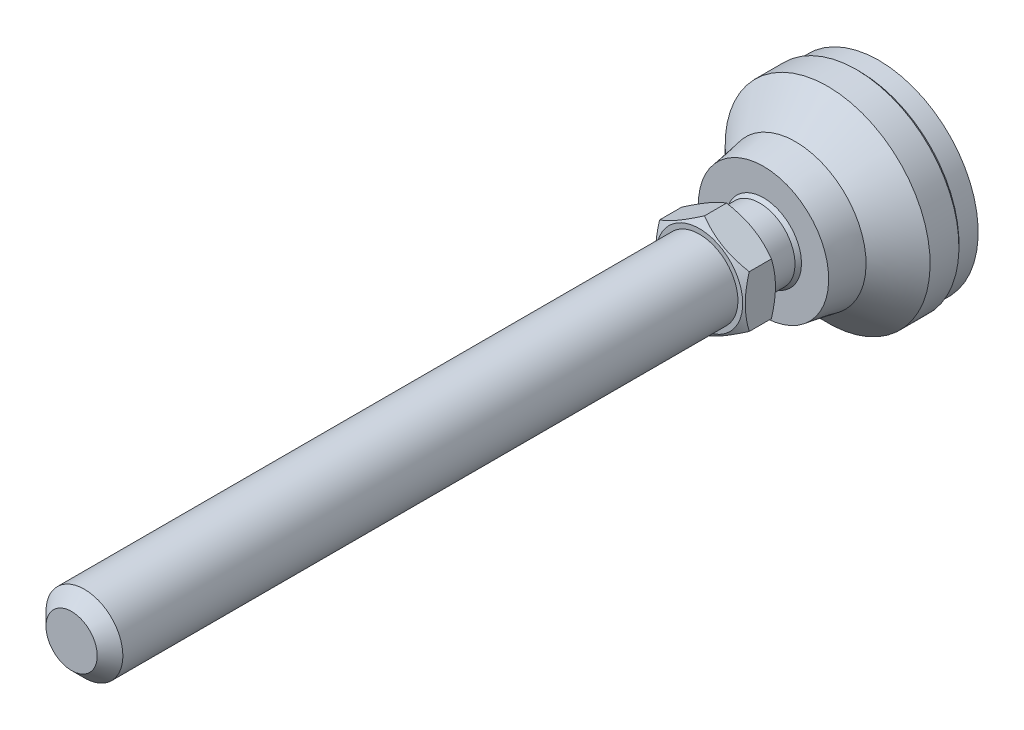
ISO-10303-21;
HEADER;
FILE_DESCRIPTION(('STEP AP214'),'2;1');
FILE_NAME('part.step','',(''),(''),'','','');
FILE_SCHEMA(('AUTOMOTIVE_DESIGN { 1 0 10303 214 1 1 1 1 }'));
ENDSEC;
DATA;
#1=APPLICATION_CONTEXT('core data for automotive mechanical design processes');
#2=APPLICATION_PROTOCOL_DEFINITION('international standard','automotive_design',2000,#1);
#3=PRODUCT_CONTEXT('',#1,'mechanical');
#4=PRODUCT('Part','Part','',(#3));
#5=PRODUCT_RELATED_PRODUCT_CATEGORY('part','',(#4));
#6=PRODUCT_DEFINITION_FORMATION('','',#4);
#7=PRODUCT_DEFINITION_CONTEXT('part definition',#1,'design');
#8=PRODUCT_DEFINITION('design','',#6,#7);
#9=PRODUCT_DEFINITION_SHAPE('','',#8);
#10=(LENGTH_UNIT() NAMED_UNIT(*) SI_UNIT(.MILLI.,.METRE.));
#11=(NAMED_UNIT(*) PLANE_ANGLE_UNIT() SI_UNIT($,.RADIAN.));
#12=(NAMED_UNIT(*) SI_UNIT($,.STERADIAN.) SOLID_ANGLE_UNIT());
#13=UNCERTAINTY_MEASURE_WITH_UNIT(LENGTH_MEASURE(1.E-05),#10,'distance_accuracy_value','');
#14=(GEOMETRIC_REPRESENTATION_CONTEXT(3) GLOBAL_UNCERTAINTY_ASSIGNED_CONTEXT((#13)) GLOBAL_UNIT_ASSIGNED_CONTEXT((#10,
#11,#12)) REPRESENTATION_CONTEXT('',''));
#15=CARTESIAN_POINT('',(0.,0.,0.));
#16=DIRECTION('',(0.,0.,1.));
#17=DIRECTION('',(1.,0.,0.));
#18=AXIS2_PLACEMENT_3D('',#15,#16,#17);
#19=CARTESIAN_POINT('',(0.,0.,3.));
#20=DIRECTION('',(0.,0.,-1.));
#21=DIRECTION('',(0.,1.,0.));
#22=AXIS2_PLACEMENT_3D('',#19,#20,#21);
#23=CYLINDRICAL_SURFACE('',#22,5.50000000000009);
#24=CARTESIAN_POINT('',(0.,0.,22.9999999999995));
#25=DIRECTION('',(0.,0.,-1.));
#26=DIRECTION('',(0.,1.,0.));
#27=AXIS2_PLACEMENT_3D('',#24,#25,#26);
#28=CIRCLE('',#27,5.50000000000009);
#29=CARTESIAN_POINT('',(0.,5.50000000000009,22.9999999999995));
#30=VERTEX_POINT('',#29);
#31=EDGE_CURVE('E112',#30,#30,#28,.T.);
#32=ORIENTED_EDGE('',*,*,#31,.T.);
#33=EDGE_LOOP('',(#32));
#34=FACE_BOUND('',#33,.T.);
#35=CARTESIAN_POINT('',(0.,0.,18.5902313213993));
#36=DIRECTION('',(0.,0.,-1.));
#37=DIRECTION('',(0.,1.,0.));
#38=AXIS2_PLACEMENT_3D('',#35,#36,#37);
#39=CIRCLE('',#38,5.50000000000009);
#40=CARTESIAN_POINT('',(-5.50000000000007,0.,18.5902313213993));
#41=VERTEX_POINT('',#40);
#42=EDGE_CURVE('E284',#41,#41,#39,.T.);
#43=ORIENTED_EDGE('',*,*,#42,.F.);
#44=EDGE_LOOP('',(#43));
#45=FACE_BOUND('',#44,.T.);
#46=ADVANCED_FACE('F14',(#34,#45),#23,.T.);
#47=CARTESIAN_POINT('',(0.,0.,14.2601043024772));
#48=DIRECTION('',(0.,0.,-1.));
#49=DIRECTION('',(-1.,0.,0.));
#50=AXIS2_PLACEMENT_3D('',#47,#48,#49);
#51=SPHERICAL_SURFACE('',#50,7.);
#52=CARTESIAN_POINT('',(0.,0.,18.));
#53=DIRECTION('',(0.,0.,-1.));
#54=DIRECTION('',(0.,1.,0.));
#55=AXIS2_PLACEMENT_3D('',#52,#53,#54);
#56=CIRCLE('',#55,5.91719360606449);
#57=CARTESIAN_POINT('',(-5.91719360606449,0.,18.));
#58=VERTEX_POINT('',#57);
#59=EDGE_CURVE('E115',#58,#58,#56,.T.);
#60=CARTESIAN_POINT('',(-5.50000000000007,0.,18.5902313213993));
#61=CARTESIAN_POINT('',(-5.50465946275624,0.,18.5843130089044));
#62=CARTESIAN_POINT('',(-5.50930937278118,0.,18.5783871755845));
#63=CARTESIAN_POINT('',(-5.51859003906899,0.,18.5665205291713));
#64=CARTESIAN_POINT('',(-5.52322079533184,0.,18.5605797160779));
#65=CARTESIAN_POINT('',(-5.53246310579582,0.,18.5486831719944));
#66=CARTESIAN_POINT('',(-5.53707465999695,0.,18.5427274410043));
#67=CARTESIAN_POINT('',(-5.54627851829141,0.,18.5308011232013));
#68=CARTESIAN_POINT('',(-5.55087082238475,0.,18.5248305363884));
#69=CARTESIAN_POINT('',(-5.56003613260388,0.,18.5128745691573));
#70=CARTESIAN_POINT('',(-5.56460913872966,0.,18.5068891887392));
#71=CARTESIAN_POINT('',(-5.57373580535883,0.,18.4949036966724));
#72=CARTESIAN_POINT('',(-5.57828946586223,0.,18.4889035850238));
#73=CARTESIAN_POINT('',(-5.58737739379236,0.,18.4768886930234));
#74=CARTESIAN_POINT('',(-5.59191166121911,0.,18.4708739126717));
#75=CARTESIAN_POINT('',(-5.60096075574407,0.,18.4588297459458));
#76=CARTESIAN_POINT('',(-5.60547558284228,0.,18.4528003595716));
#77=CARTESIAN_POINT('',(-5.6144857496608,0.,18.4407270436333));
#78=CARTESIAN_POINT('',(-5.61898108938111,0.,18.4346831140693));
#79=CARTESIAN_POINT('',(-5.62795223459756,0.,18.4225807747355));
#80=CARTESIAN_POINT('',(-5.6324280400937,0.,18.4165223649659));
#81=CARTESIAN_POINT('',(-5.64136007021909,0.,18.4043911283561));
#82=CARTESIAN_POINT('',(-5.64581629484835,0.,18.398318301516));
#83=CARTESIAN_POINT('',(-5.65470911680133,0.,18.3861582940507));
#84=CARTESIAN_POINT('',(-5.65914571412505,0.,18.3800711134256));
#85=CARTESIAN_POINT('',(-5.66799923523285,0.,18.3678824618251));
#86=CARTESIAN_POINT('',(-5.67241615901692,0.,18.3617809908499));
#87=CARTESIAN_POINT('',(-5.68123028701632,0.,18.3495638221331));
#88=CARTESIAN_POINT('',(-5.68562749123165,0.,18.3434481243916));
#89=CARTESIAN_POINT('',(-5.69440213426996,0.,18.3312025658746));
#90=CARTESIAN_POINT('',(-5.69877957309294,0.,18.3250727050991));
#91=CARTESIAN_POINT('',(-5.70751463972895,0.,18.3127988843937));
#92=CARTESIAN_POINT('',(-5.71187226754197,0.,18.3066549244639));
#93=CARTESIAN_POINT('',(-5.72056766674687,0.,18.2943529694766));
#94=CARTESIAN_POINT('',(-5.72490543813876,0.,18.2881949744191));
#95=CARTESIAN_POINT('',(-5.73356107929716,0.,18.2758650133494));
#96=CARTESIAN_POINT('',(-5.73787894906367,0.,18.2696930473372));
#97=CARTESIAN_POINT('',(-5.74649474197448,0.,18.2573352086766));
#98=CARTESIAN_POINT('',(-5.75079266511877,0.,18.2511493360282));
#99=CARTESIAN_POINT('',(-5.75936851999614,0.,18.2387637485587));
#100=CARTESIAN_POINT('',(-5.76364645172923,0.,18.2325640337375));
#101=CARTESIAN_POINT('',(-5.77218227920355,0.,18.2201508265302));
#102=CARTESIAN_POINT('',(-5.77644017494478,0.,18.2139373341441));
#103=CARTESIAN_POINT('',(-5.78493588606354,0.,18.2014966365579));
#104=CARTESIAN_POINT('',(-5.78917370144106,0.,18.195269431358));
#105=CARTESIAN_POINT('',(-5.79762920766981,0.,18.1828013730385));
#106=CARTESIAN_POINT('',(-5.80184689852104,0.,18.1765605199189));
#107=CARTESIAN_POINT('',(-5.81026211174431,0.,18.1640652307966));
#108=CARTESIAN_POINT('',(-5.81445963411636,0.,18.1578107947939));
#109=CARTESIAN_POINT('',(-5.82283446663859,0.,18.1452884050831));
#110=CARTESIAN_POINT('',(-5.82701177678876,0.,18.1390204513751));
#111=CARTESIAN_POINT('',(-5.83534614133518,0.,18.1264710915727));
#112=CARTESIAN_POINT('',(-5.83950319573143,0.,18.1201896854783));
#113=CARTESIAN_POINT('',(-5.84779700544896,0.,18.107613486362));
#114=CARTESIAN_POINT('',(-5.85193376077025,0.,18.1013186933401));
#115=CARTESIAN_POINT('',(-5.86018692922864,0.,18.0887157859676));
#116=CARTESIAN_POINT('',(-5.86430334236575,0.,18.082407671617));
#117=CARTESIAN_POINT('',(-5.87251578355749,0.,18.0697781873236));
#118=CARTESIAN_POINT('',(-5.87661181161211,0.,18.063456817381));
#119=CARTESIAN_POINT('',(-5.88478343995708,0.,18.0508008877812));
#120=CARTESIAN_POINT('',(-5.88885904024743,0.,18.044466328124));
#121=CARTESIAN_POINT('',(-5.89698977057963,0.,18.0317840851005));
#122=CARTESIAN_POINT('',(-5.90104490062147,0.,18.0254364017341));
#123=CARTESIAN_POINT('',(-5.909134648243,0.,18.0127279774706));
#124=CARTESIAN_POINT('',(-5.91316926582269,0.,18.0063672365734));
#125=CARTESIAN_POINT('',(-5.91719360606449,0.,18.));
#126=B_SPLINE_CURVE_WITH_KNOTS('',3,(#60,#61,#62,#63,#64,#65,#66,#67,#68,#69,#70,#71,#72,#73,
#74,#75,#76,#77,#78,#79,#80,#81,#82,#83,#84,#85,#86,#87,#88,#89,#90,#91,#92,#93,#94,#95,#96,#97,
#98,#99,#100,#101,#102,#103,#104,#105,#106,#107,#108,#109,#110,#111,#112,#113,#114,#115,#116,
#117,#118,#119,#120,#121,#122,#123,#124,#125),.UNSPECIFIED.,.F.,.F.,(4,2,2,2,2,2,2,2,2,2,2,2,2,
2,2,2,2,2,2,2,2,2,2,2,2,2,2,2,2,2,2,2,4),(0.,0.0225971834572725,0.0451943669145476,
0.067791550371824,0.0903887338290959,0.112985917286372,0.135583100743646,0.158180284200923,
0.180777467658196,0.203374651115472,0.225971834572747,0.24856901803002,0.271166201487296,
0.293763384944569,0.316360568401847,0.338957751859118,0.361554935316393,0.384152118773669,
0.406749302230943,0.429346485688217,0.451943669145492,0.474540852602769,0.49713803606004,
0.519735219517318,0.542332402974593,0.564929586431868,0.587526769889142,0.610123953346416,
0.632721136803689,0.655318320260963,0.67791550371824,0.700512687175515,0.723109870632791),.UNSPECIFIED.);
#127=EDGE_CURVE('BSEAM243',#41,#58,#126,.T.);
#128=ORIENTED_EDGE('',*,*,#42,.T.);
#129=ORIENTED_EDGE('',*,*,#59,.F.);
#130=ORIENTED_EDGE('',*,*,#127,.T.);
#131=ORIENTED_EDGE('',*,*,#127,.F.);
#132=EDGE_LOOP('',(#128,#130,#129,#131));
#133=FACE_BOUND('',#132,.T.);
#134=ADVANCED_FACE('F243',(#133),#51,.T.);
#135=CARTESIAN_POINT('',(0.,0.,3.5));
#136=DIRECTION('',(0.,0.,1.));
#137=DIRECTION('',(0.,-1.,0.));
#138=AXIS2_PLACEMENT_3D('',#135,#136,#137);
#139=CONICAL_SURFACE('',#138,16.,0.785398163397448);
#140=CARTESIAN_POINT('',(0.,0.,3.));
#141=DIRECTION('',(0.,0.,-1.));
#142=DIRECTION('',(0.,1.,0.));
#143=AXIS2_PLACEMENT_3D('',#140,#141,#142);
#144=CIRCLE('',#143,15.5);
#145=CARTESIAN_POINT('',(0.,15.5,3.));
#146=VERTEX_POINT('',#145);
#147=EDGE_CURVE('E85',#146,#146,#144,.T.);
#148=ORIENTED_EDGE('',*,*,#147,.F.);
#149=EDGE_LOOP('',(#148));
#150=FACE_BOUND('',#149,.T.);
#151=CARTESIAN_POINT('',(0.,0.,3.5));
#152=DIRECTION('',(0.,0.,-1.));
#153=DIRECTION('',(0.,1.,0.));
#154=AXIS2_PLACEMENT_3D('',#151,#152,#153);
#155=CIRCLE('',#154,16.);
#156=CARTESIAN_POINT('',(0.,16.,3.5));
#157=VERTEX_POINT('',#156);
#158=EDGE_CURVE('E88',#157,#157,#155,.T.);
#159=ORIENTED_EDGE('',*,*,#158,.T.);
#160=EDGE_LOOP('',(#159));
#161=FACE_BOUND('',#160,.T.);
#162=ADVANCED_FACE('F246',(#150,#161),#139,.T.);
#163=CARTESIAN_POINT('',(0.,0.,3.));
#164=DIRECTION('',(0.,0.,-1.));
#165=DIRECTION('',(0.,1.,0.));
#166=AXIS2_PLACEMENT_3D('',#163,#164,#165);
#167=CYLINDRICAL_SURFACE('',#166,16.);
#168=ORIENTED_EDGE('',*,*,#158,.F.);
#169=EDGE_LOOP('',(#168));
#170=FACE_BOUND('',#169,.T.);
#171=CARTESIAN_POINT('',(0.,0.,8.00000000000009));
#172=DIRECTION('',(0.,0.,-1.));
#173=DIRECTION('',(0.,1.,0.));
#174=AXIS2_PLACEMENT_3D('',#171,#172,#173);
#175=CIRCLE('',#174,16.);
#176=CARTESIAN_POINT('',(0.,16.,8.00000000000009));
#177=VERTEX_POINT('',#176);
#178=EDGE_CURVE('E105',#177,#177,#175,.T.);
#179=ORIENTED_EDGE('',*,*,#178,.T.);
#180=EDGE_LOOP('',(#179));
#181=FACE_BOUND('',#180,.T.);
#182=ADVANCED_FACE('F392',(#170,#181),#167,.T.);
#183=CARTESIAN_POINT('',(0.,0.,13.));
#184=DIRECTION('',(0.,0.,-1.));
#185=DIRECTION('',(0.,1.,0.));
#186=AXIS2_PLACEMENT_3D('',#183,#184,#185);
#187=CONICAL_SURFACE('',#186,11.,0.785398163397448);
#188=ORIENTED_EDGE('',*,*,#178,.F.);
#189=EDGE_LOOP('',(#188));
#190=FACE_BOUND('',#189,.T.);
#191=CARTESIAN_POINT('',(0.,0.,13.));
#192=DIRECTION('',(0.,0.,-1.));
#193=DIRECTION('',(0.,1.,0.));
#194=AXIS2_PLACEMENT_3D('',#191,#192,#193);
#195=CIRCLE('',#194,11.);
#196=CARTESIAN_POINT('',(0.,11.,13.));
#197=VERTEX_POINT('',#196);
#198=EDGE_CURVE('E108',#197,#197,#195,.T.);
#199=ORIENTED_EDGE('',*,*,#198,.T.);
#200=EDGE_LOOP('',(#199));
#201=FACE_BOUND('',#200,.T.);
#202=ADVANCED_FACE('F399',(#190,#201),#187,.T.);
#203=CARTESIAN_POINT('',(0.,0.,19.));
#204=DIRECTION('',(0.,0.,-1.));
#205=DIRECTION('',(0.,1.,0.));
#206=AXIS2_PLACEMENT_3D('',#203,#204,#205);
#207=CONICAL_SURFACE('',#206,10.,0.165148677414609);
#208=ORIENTED_EDGE('',*,*,#198,.F.);
#209=EDGE_LOOP('',(#208));
#210=FACE_BOUND('',#209,.T.);
#211=CARTESIAN_POINT('',(0.,0.,18.));
#212=DIRECTION('',(0.,0.,-1.));
#213=DIRECTION('',(0.,1.,0.));
#214=AXIS2_PLACEMENT_3D('',#211,#212,#213);
#215=CIRCLE('',#214,10.1666666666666);
#216=CARTESIAN_POINT('',(0.,10.1666666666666,18.));
#217=VERTEX_POINT('',#216);
#218=EDGE_CURVE('E93',#217,#217,#215,.T.);
#219=ORIENTED_EDGE('',*,*,#218,.T.);
#220=EDGE_LOOP('',(#219));
#221=FACE_BOUND('',#220,.T.);
#222=ADVANCED_FACE('F241',(#210,#221),#207,.T.);
#223=CARTESIAN_POINT('',(-6.60079601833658,0.,18.));
#224=DIRECTION('',(0.,0.,1.));
#225=DIRECTION('',(0.,-1.,0.));
#226=AXIS2_PLACEMENT_3D('',#223,#224,#225);
#227=PLANE('',#226);
#228=ORIENTED_EDGE('',*,*,#218,.F.);
#229=EDGE_LOOP('',(#228));
#230=FACE_BOUND('',#229,.T.);
#231=ORIENTED_EDGE('',*,*,#59,.T.);
#232=EDGE_LOOP('',(#231));
#233=FACE_BOUND('',#232,.T.);
#234=ADVANCED_FACE('F236',(#230,#233),#227,.T.);
#235=CARTESIAN_POINT('',(0.,-8.08290376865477,22.9999999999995));
#236=DIRECTION('',(0.,0.,-1.));
#237=DIRECTION('',(0.,1.,0.));
#238=AXIS2_PLACEMENT_3D('',#235,#236,#237);
#239=PLANE('',#238);
#240=CARTESIAN_POINT('',(0.,0.,22.9999999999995));
#241=DIRECTION('',(0.,0.,1.));
#242=DIRECTION('',(0.,-1.,0.));
#243=AXIS2_PLACEMENT_3D('',#240,#241,#242);
#244=CIRCLE('',#243,6.75);
#245=CARTESIAN_POINT('',(0.,-6.75,22.9999999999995));
#246=VERTEX_POINT('',#245);
#247=EDGE_CURVE('E80',#246,#246,#244,.T.);
#248=ORIENTED_EDGE('',*,*,#247,.F.);
#249=EDGE_LOOP('',(#248));
#250=FACE_BOUND('',#249,.T.);
#251=ORIENTED_EDGE('',*,*,#31,.F.);
#252=EDGE_LOOP('',(#251));
#253=FACE_BOUND('',#252,.T.);
#254=ADVANCED_FACE('F240',(#250,#253),#239,.T.);
#255=CARTESIAN_POINT('',(0.,0.,0.));
#256=DIRECTION('',(0.,0.,1.));
#257=DIRECTION('',(0.,-1.,0.));
#258=AXIS2_PLACEMENT_3D('',#255,#256,#257);
#259=CYLINDRICAL_SURFACE('',#258,15.5);
#260=CARTESIAN_POINT('',(0.,0.,0.));
#261=DIRECTION('',(0.,0.,-1.));
#262=DIRECTION('',(0.,1.,0.));
#263=AXIS2_PLACEMENT_3D('',#260,#261,#262);
#264=CIRCLE('',#263,15.5);
#265=CARTESIAN_POINT('',(0.,15.5,0.));
#266=VERTEX_POINT('',#265);
#267=EDGE_CURVE('E293',#266,#266,#264,.T.);
#268=ORIENTED_EDGE('',*,*,#267,.F.);
#269=EDGE_LOOP('',(#268));
#270=FACE_BOUND('',#269,.T.);
#271=ORIENTED_EDGE('',*,*,#147,.T.);
#272=EDGE_LOOP('',(#271));
#273=FACE_BOUND('',#272,.T.);
#274=ADVANCED_FACE('F250',(#270,#273),#259,.T.);
#275=CARTESIAN_POINT('',(0.,0.,0.));
#276=DIRECTION('',(0.,0.,-1.));
#277=DIRECTION('',(0.,1.,0.));
#278=AXIS2_PLACEMENT_3D('',#275,#276,#277);
#279=PLANE('',#278);
#280=ORIENTED_EDGE('',*,*,#267,.T.);
#281=EDGE_LOOP('',(#280));
#282=FACE_BOUND('',#281,.T.);
#283=ADVANCED_FACE('F133',(#282),#279,.T.);
#284=CARTESIAN_POINT('',(0.,0.,22.9999999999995));
#285=DIRECTION('',(0.,0.,1.));
#286=DIRECTION('',(0.,-1.,0.));
#287=AXIS2_PLACEMENT_3D('',#284,#285,#286);
#288=CONICAL_SURFACE('',#287,6.75,1.0471975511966);
#289=CARTESIAN_POINT('',(7.0002,-4.04133641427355,23.7696190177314));
#290=CARTESIAN_POINT('',(6.84633209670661,-4.13017208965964,23.7183374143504));
#291=CARTESIAN_POINT('',(6.69189049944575,-4.21933898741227,23.6693831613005));
#292=CARTESIAN_POINT('',(6.38175307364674,-4.3983969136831,23.576770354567));
#293=CARTESIAN_POINT('',(6.22605673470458,-4.4882882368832,23.5331140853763));
#294=CARTESIAN_POINT('',(5.75647483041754,-4.7594014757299,23.4109491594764));
#295=CARTESIAN_POINT('',(5.4407356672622,-4.94169356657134,23.3414631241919));
#296=CARTESIAN_POINT('',(4.96823775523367,-5.21449036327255,23.259982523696));
#297=CARTESIAN_POINT('',(4.81289077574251,-5.30417998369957,23.2367710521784));
#298=CARTESIAN_POINT('',(4.50149488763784,-5.48396448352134,23.1978487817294));
#299=CARTESIAN_POINT('',(4.34544604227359,-5.57405932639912,23.1821373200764));
#300=CARTESIAN_POINT('',(4.03307732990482,-5.75440548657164,23.15861548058));
#301=CARTESIAN_POINT('',(3.87675797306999,-5.84465650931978,23.1507961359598));
#302=CARTESIAN_POINT('',(3.56398349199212,-6.02523694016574,23.1432178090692));
#303=CARTESIAN_POINT('',(3.40752837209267,-6.11556634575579,23.1434585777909));
#304=CARTESIAN_POINT('',(2.97889312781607,-6.36303901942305,23.1551972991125));
#305=CARTESIAN_POINT('',(2.7068533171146,-6.52010127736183,23.1749033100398));
#306=CARTESIAN_POINT('',(2.16458055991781,-6.83318259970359,23.2373910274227));
#307=CARTESIAN_POINT('',(1.89434952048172,-6.98920056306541,23.2801940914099));
#308=CARTESIAN_POINT('',(1.35098545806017,-7.30291195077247,23.3871892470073));
#309=CARTESIAN_POINT('',(1.07792099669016,-7.46056579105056,23.4518346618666));
#310=CARTESIAN_POINT('',(0.535864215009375,-7.77352241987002,23.5985536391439));
#311=CARTESIAN_POINT('',(0.266864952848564,-7.92882921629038,23.6805927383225));
#312=CARTESIAN_POINT('',(-0.000199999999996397,-8.08301923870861,23.7696190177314));
#313=B_SPLINE_CURVE_WITH_KNOTS('',3,(#289,#290,#291,#292,#293,#294,#295,#296,#297,#298,#299,
#300,#301,#302,#303,#304,#305,#306,#307,#308,#309,#310,#311,#312),.UNSPECIFIED.,.F.,.F.,(4,2,2,
2,2,2,2,2,2,2,2,4),(0.,0.554727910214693,1.10969417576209,2.2219327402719,2.76443041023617,
3.30688013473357,3.8487128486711,4.39052882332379,5.33376515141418,6.27787517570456,
7.24292418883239,8.20607866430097),.UNSPECIFIED.);
#314=CARTESIAN_POINT('',(7.,-4.04145188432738,23.7695523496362));
#315=VERTEX_POINT('',#314);
#316=CARTESIAN_POINT('',(0.,-8.08290376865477,23.7695523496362));
#317=VERTEX_POINT('',#316);
#318=EDGE_CURVE('E33',#315,#317,#313,.T.);
#319=ORIENTED_EDGE('',*,*,#318,.T.);
#320=CARTESIAN_POINT('',(0.000200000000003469,-8.0830192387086,23.7696190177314));
#321=CARTESIAN_POINT('',(-0.15366790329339,-7.99418356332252,23.7183374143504));
#322=CARTESIAN_POINT('',(-0.308109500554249,-7.90501666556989,23.6693831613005));
#323=CARTESIAN_POINT('',(-0.618246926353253,-7.72595873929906,23.576770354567));
#324=CARTESIAN_POINT('',(-0.773943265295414,-7.63606741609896,23.5331140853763));
#325=CARTESIAN_POINT('',(-1.24352516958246,-7.36495417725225,23.4109491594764));
#326=CARTESIAN_POINT('',(-1.5592643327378,-7.18266208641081,23.3414631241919));
#327=CARTESIAN_POINT('',(-2.03176224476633,-6.90986528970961,23.259982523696));
#328=CARTESIAN_POINT('',(-2.18710922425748,-6.82017566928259,23.2367710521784));
#329=CARTESIAN_POINT('',(-2.49850511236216,-6.64039116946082,23.1978487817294));
#330=CARTESIAN_POINT('',(-2.65455395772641,-6.55029632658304,23.1821373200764));
#331=CARTESIAN_POINT('',(-2.96692267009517,-6.36995016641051,23.15861548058));
#332=CARTESIAN_POINT('',(-3.12324202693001,-6.27969914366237,23.1507961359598));
#333=CARTESIAN_POINT('',(-3.43601650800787,-6.09911871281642,23.1432178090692));
#334=CARTESIAN_POINT('',(-3.59247162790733,-6.00878930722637,23.1434585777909));
#335=CARTESIAN_POINT('',(-4.02110687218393,-5.76131663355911,23.1551972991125));
#336=CARTESIAN_POINT('',(-4.29314668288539,-5.60425437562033,23.1749033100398));
#337=CARTESIAN_POINT('',(-4.83541944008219,-5.29117305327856,23.2373910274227));
#338=CARTESIAN_POINT('',(-5.10565047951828,-5.13515508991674,23.2801940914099));
#339=CARTESIAN_POINT('',(-5.64901454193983,-4.82144370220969,23.3871892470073));
#340=CARTESIAN_POINT('',(-5.92207900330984,-4.6637898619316,23.4518346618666));
#341=CARTESIAN_POINT('',(-6.46413578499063,-4.35083323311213,23.5985536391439));
#342=CARTESIAN_POINT('',(-6.73313504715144,-4.19552643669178,23.6805927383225));
#343=CARTESIAN_POINT('',(-7.0002,-4.04133641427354,23.7696190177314));
#344=B_SPLINE_CURVE_WITH_KNOTS('',3,(#320,#321,#322,#323,#324,#325,#326,#327,#328,#329,#330,
#331,#332,#333,#334,#335,#336,#337,#338,#339,#340,#341,#342,#343),.UNSPECIFIED.,.F.,.F.,(4,2,2,
2,2,2,2,2,2,2,2,4),(0.,0.554727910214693,1.10969417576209,2.2219327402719,2.76443041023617,
3.30688013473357,3.84871284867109,4.39052882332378,5.33376515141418,6.27787517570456,
7.2429241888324,8.20607866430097),.UNSPECIFIED.);
#345=CARTESIAN_POINT('',(-7.,-4.04145188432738,23.7695523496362));
#346=VERTEX_POINT('',#345);
#347=EDGE_CURVE('E9',#317,#346,#344,.T.);
#348=ORIENTED_EDGE('',*,*,#347,.T.);
#349=CARTESIAN_POINT('',(-7.,10.8088028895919,26.5377185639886));
#350=CARTESIAN_POINT('',(-7.,10.5034568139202,26.3897880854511));
#351=CARTESIAN_POINT('',(-7.,10.1974047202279,26.2432897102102));
#352=CARTESIAN_POINT('',(-7.,9.58351283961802,25.9539635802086));
#353=CARTESIAN_POINT('',(-7.,9.27567277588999,25.81113641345));
#354=CARTESIAN_POINT('',(-7.,8.65622054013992,25.5292304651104));
#355=CARTESIAN_POINT('',(-7.,8.34459692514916,25.3901767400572));
#356=CARTESIAN_POINT('',(-7.,7.71885465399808,25.117823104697));
#357=CARTESIAN_POINT('',(-7.,7.40473611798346,24.9845229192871));
#358=CARTESIAN_POINT('',(-7.,6.76355084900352,24.7211079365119));
#359=CARTESIAN_POINT('',(-7.,6.43638798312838,24.5912258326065));
#360=CARTESIAN_POINT('',(-7.,5.7782181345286,24.341405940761));
#361=CARTESIAN_POINT('',(-7.,5.44721072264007,24.2214692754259));
#362=CARTESIAN_POINT('',(-7.,4.78145606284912,23.9947237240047));
#363=CARTESIAN_POINT('',(-7.,4.44671810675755,23.8878878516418));
#364=CARTESIAN_POINT('',(-7.,3.77245317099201,23.690801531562));
#365=CARTESIAN_POINT('',(-7.,3.4329277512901,23.6005458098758));
#366=CARTESIAN_POINT('',(-7.,2.75071226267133,23.4414652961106));
#367=CARTESIAN_POINT('',(-7.,2.40804960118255,23.3725261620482));
#368=CARTESIAN_POINT('',(-7.,1.89097320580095,23.2881132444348));
#369=CARTESIAN_POINT('',(-7.,1.71808761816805,23.2631404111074));
#370=CARTESIAN_POINT('',(-7.,1.37147320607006,23.2200175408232));
#371=CARTESIAN_POINT('',(-7.,1.19774446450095,23.2018668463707));
#372=CARTESIAN_POINT('',(-7.,0.851925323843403,23.1729750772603));
#373=CARTESIAN_POINT('',(-7.,0.679842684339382,23.1621414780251));
#374=CARTESIAN_POINT('',(-7.,0.335373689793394,23.147757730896));
#375=CARTESIAN_POINT('',(-7.,0.16298733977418,23.1442074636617));
#376=CARTESIAN_POINT('',(-7.,-0.181781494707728,23.1444749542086));
#377=CARTESIAN_POINT('',(-7.,-0.354163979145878,23.1482927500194));
#378=CARTESIAN_POINT('',(-7.,-0.698616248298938,23.1632038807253));
#379=CARTESIAN_POINT('',(-7.,-0.870686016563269,23.174297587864));
#380=CARTESIAN_POINT('',(-7.,-1.2856581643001,23.209592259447));
#381=CARTESIAN_POINT('',(-7.,-1.52826633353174,23.2373250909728));
#382=CARTESIAN_POINT('',(-7.,-2.01163956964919,23.3057306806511));
#383=CARTESIAN_POINT('',(-7.,-2.25240437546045,23.3464052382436));
#384=CARTESIAN_POINT('',(-7.,-2.97168230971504,23.4856810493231));
#385=CARTESIAN_POINT('',(-7.,-3.44690177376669,23.601507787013));
#386=CARTESIAN_POINT('',(-7.,-4.15742131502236,23.8018270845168));
#387=CARTESIAN_POINT('',(-7.,-4.39642017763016,23.8739502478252));
#388=CARTESIAN_POINT('',(-7.,-4.87209566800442,24.0255542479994));
#389=CARTESIAN_POINT('',(-7.,-5.10877228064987,24.105035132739));
#390=CARTESIAN_POINT('',(-7.,-5.57988032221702,24.2700904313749));
#391=CARTESIAN_POINT('',(-7.,-5.81431249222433,24.3556627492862));
#392=CARTESIAN_POINT('',(-7.,-6.28124348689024,24.5319073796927));
#393=CARTESIAN_POINT('',(-7.,-6.51374233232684,24.6225796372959));
#394=CARTESIAN_POINT('',(-7.,-7.05472497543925,24.8393032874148));
#395=CARTESIAN_POINT('',(-7.,-7.36253993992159,24.9670209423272));
#396=CARTESIAN_POINT('',(-7.,-7.97561884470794,25.2284559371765));
#397=CARTESIAN_POINT('',(-7.,-8.28088263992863,25.3621736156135));
#398=CARTESIAN_POINT('',(-7.,-8.88931840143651,25.6344252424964));
#399=CARTESIAN_POINT('',(-7.,-9.19248996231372,25.7729600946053));
#400=CARTESIAN_POINT('',(-7.,-9.79703779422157,26.0538998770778));
#401=CARTESIAN_POINT('',(-7.,-10.0984140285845,26.1963048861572));
#402=CARTESIAN_POINT('',(-7.,-10.6999596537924,26.484414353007));
#403=CARTESIAN_POINT('',(-7.,-11.0001275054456,26.63012201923));
#404=CARTESIAN_POINT('',(-7.,-11.5991847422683,26.924144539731));
#405=CARTESIAN_POINT('',(-7.,-11.8980741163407,27.0724594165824));
#406=CARTESIAN_POINT('',(-7.,-12.7930504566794,27.5205952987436));
#407=CARTESIAN_POINT('',(-7.,-13.3875211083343,27.8236439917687));
#408=CARTESIAN_POINT('',(-7.,-14.5248698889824,28.4108178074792));
#409=CARTESIAN_POINT('',(-7.,-15.0679952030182,28.6944662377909));
#410=CARTESIAN_POINT('',(-7.,-16.1522217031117,29.2656459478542));
#411=CARTESIAN_POINT('',(-7.,-16.6933228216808,29.5531773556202));
#412=CARTESIAN_POINT('',(-7.,-17.7726524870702,30.1305164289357));
#413=CARTESIAN_POINT('',(-7.,-18.3108848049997,30.4203170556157));
#414=CARTESIAN_POINT('',(-7.,-19.3860507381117,31.002251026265));
#415=CARTESIAN_POINT('',(-7.,-19.9229844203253,31.2943842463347));
#416=CARTESIAN_POINT('',(-7.,-20.4594379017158,31.5873907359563));
#417=B_SPLINE_CURVE_WITH_KNOTS('',3,(#349,#350,#351,#352,#353,#354,#355,#356,#357,#358,#359,
#360,#361,#362,#363,#364,#365,#366,#367,#368,#369,#370,#371,#372,#373,#374,#375,#376,#377,#378,
#379,#380,#381,#382,#383,#384,#385,#386,#387,#388,#389,#390,#391,#392,#393,#394,#395,#396,#397,
#398,#399,#400,#401,#402,#403,#404,#405,#406,#407,#408,#409,#410,#411,#412,#413,#414,#415,#416),
.UNSPECIFIED.,.F.,.F.,(4,2,2,2,2,2,2,2,2,2,2,2,2,2,2,2,2,2,2,2,2,2,2,2,2,2,2,2,2,2,2,2,2,4),(0.,
1.01789127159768,2.03594457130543,3.0596200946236,4.08324661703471,5.13912502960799,
6.1951224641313,7.2489067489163,8.30235525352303,9.35005091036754,9.87397717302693,
10.397852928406,10.9149736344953,11.4320858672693,11.9492007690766,12.4663421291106,
13.1984917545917,13.9307432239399,15.3960778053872,16.1449495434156,16.8938261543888,
17.6424463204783,18.3910584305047,19.3907518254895,20.3905016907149,21.3904401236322,
22.3903989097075,23.3913747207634,24.3923592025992,26.3940767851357,28.2322585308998,
30.0705010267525,31.9043721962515,33.7381465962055),.UNSPECIFIED.);
#418=CARTESIAN_POINT('',(-7.,4.04145188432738,23.7695523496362));
#419=VERTEX_POINT('',#418);
#420=EDGE_CURVE('E72',#346,#419,#417,.F.);
#421=ORIENTED_EDGE('',*,*,#420,.T.);
#422=CARTESIAN_POINT('',(-7.0002,4.04133641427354,23.7696190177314));
#423=CARTESIAN_POINT('',(-6.84633209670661,4.13017208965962,23.7183374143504));
#424=CARTESIAN_POINT('',(-6.69189049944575,4.21933898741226,23.6693831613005));
#425=CARTESIAN_POINT('',(-6.38175307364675,4.39839691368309,23.576770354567));
#426=CARTESIAN_POINT('',(-6.22605673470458,4.48828823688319,23.5331140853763));
#427=CARTESIAN_POINT('',(-5.75647483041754,4.75940147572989,23.4109491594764));
#428=CARTESIAN_POINT('',(-5.4407356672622,4.94169356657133,23.3414631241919));
#429=CARTESIAN_POINT('',(-4.96823775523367,5.21449036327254,23.259982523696));
#430=CARTESIAN_POINT('',(-4.81289077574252,5.30417998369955,23.2367710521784));
#431=CARTESIAN_POINT('',(-4.50149488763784,5.48396448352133,23.1978487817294));
#432=CARTESIAN_POINT('',(-4.34544604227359,5.57405932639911,23.1821373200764));
#433=CARTESIAN_POINT('',(-4.03307732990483,5.75440548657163,23.15861548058));
#434=CARTESIAN_POINT('',(-3.87675797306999,5.84465650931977,23.1507961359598));
#435=CARTESIAN_POINT('',(-3.56398349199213,6.02523694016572,23.1432178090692));
#436=CARTESIAN_POINT('',(-3.40752837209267,6.11556634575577,23.1434585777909));
#437=CARTESIAN_POINT('',(-2.97889312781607,6.36303901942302,23.1551972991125));
#438=CARTESIAN_POINT('',(-2.7068533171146,6.52010127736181,23.1749033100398));
#439=CARTESIAN_POINT('',(-2.16458055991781,6.83318259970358,23.2373910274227));
#440=CARTESIAN_POINT('',(-1.89434952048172,6.9892005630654,23.2801940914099));
#441=CARTESIAN_POINT('',(-1.35098545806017,7.30291195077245,23.3871892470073));
#442=CARTESIAN_POINT('',(-1.07792099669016,7.46056579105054,23.4518346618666));
#443=CARTESIAN_POINT('',(-0.535864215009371,7.77352241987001,23.5985536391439));
#444=CARTESIAN_POINT('',(-0.26686495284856,7.92882921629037,23.6805927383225));
#445=CARTESIAN_POINT('',(0.000199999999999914,8.0830192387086,23.7696190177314));
#446=B_SPLINE_CURVE_WITH_KNOTS('',3,(#422,#423,#424,#425,#426,#427,#428,#429,#430,#431,#432,
#433,#434,#435,#436,#437,#438,#439,#440,#441,#442,#443,#444,#445),.UNSPECIFIED.,.F.,.F.,(4,2,2,
2,2,2,2,2,2,2,2,4),(0.,0.554727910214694,1.10969417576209,2.2219327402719,2.76443041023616,
3.30688013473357,3.84871284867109,4.39052882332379,5.33376515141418,6.27787517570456,
7.2429241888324,8.20607866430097),.UNSPECIFIED.);
#447=CARTESIAN_POINT('',(0.,8.08290376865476,23.7695523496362));
#448=VERTEX_POINT('',#447);
#449=EDGE_CURVE('E79',#419,#448,#446,.T.);
#450=ORIENTED_EDGE('',*,*,#449,.T.);
#451=CARTESIAN_POINT('',(-0.000200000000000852,8.0830192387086,23.7696190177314));
#452=CARTESIAN_POINT('',(0.15366790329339,7.99418356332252,23.7183374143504));
#453=CARTESIAN_POINT('',(0.308109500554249,7.90501666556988,23.6693831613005));
#454=CARTESIAN_POINT('',(0.618246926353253,7.72595873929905,23.576770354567));
#455=CARTESIAN_POINT('',(0.773943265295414,7.63606741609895,23.5331140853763));
#456=CARTESIAN_POINT('',(1.24352516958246,7.36495417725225,23.4109491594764));
#457=CARTESIAN_POINT('',(1.5592643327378,7.18266208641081,23.3414631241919));
#458=CARTESIAN_POINT('',(2.03176224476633,6.9098652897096,23.259982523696));
#459=CARTESIAN_POINT('',(2.18710922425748,6.82017566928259,23.2367710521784));
#460=CARTESIAN_POINT('',(2.49850511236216,6.64039116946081,23.1978487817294));
#461=CARTESIAN_POINT('',(2.6545539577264,6.55029632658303,23.1821373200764));
#462=CARTESIAN_POINT('',(2.96692267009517,6.36995016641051,23.15861548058));
#463=CARTESIAN_POINT('',(3.12324202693,6.27969914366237,23.1507961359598));
#464=CARTESIAN_POINT('',(3.43601650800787,6.09911871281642,23.1432178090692));
#465=CARTESIAN_POINT('',(3.59247162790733,6.00878930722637,23.1434585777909));
#466=CARTESIAN_POINT('',(4.02110687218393,5.76131663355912,23.1551972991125));
#467=CARTESIAN_POINT('',(4.2931466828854,5.60425437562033,23.1749033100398));
#468=CARTESIAN_POINT('',(4.83541944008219,5.29117305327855,23.2373910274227));
#469=CARTESIAN_POINT('',(5.10565047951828,5.13515508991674,23.2801940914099));
#470=CARTESIAN_POINT('',(5.64901454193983,4.82144370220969,23.3871892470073));
#471=CARTESIAN_POINT('',(5.92207900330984,4.66378986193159,23.4518346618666));
#472=CARTESIAN_POINT('',(6.46413578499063,4.35083323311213,23.5985536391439));
#473=CARTESIAN_POINT('',(6.73313504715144,4.19552643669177,23.6805927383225));
#474=CARTESIAN_POINT('',(7.0002,4.04133641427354,23.7696190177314));
#475=B_SPLINE_CURVE_WITH_KNOTS('',3,(#451,#452,#453,#454,#455,#456,#457,#458,#459,#460,#461,
#462,#463,#464,#465,#466,#467,#468,#469,#470,#471,#472,#473,#474),.UNSPECIFIED.,.F.,.F.,(4,2,2,
2,2,2,2,2,2,2,2,4),(0.,0.554727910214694,1.10969417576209,2.2219327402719,2.76443041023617,
3.30688013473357,3.8487128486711,4.39052882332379,5.33376515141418,6.27787517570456,
7.2429241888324,8.20607866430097),.UNSPECIFIED.);
#476=CARTESIAN_POINT('',(7.,4.04145188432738,23.7695523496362));
#477=VERTEX_POINT('',#476);
#478=EDGE_CURVE('E194',#448,#477,#475,.T.);
#479=ORIENTED_EDGE('',*,*,#478,.T.);
#480=CARTESIAN_POINT('',(7.,10.8088028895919,26.5377185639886));
#481=CARTESIAN_POINT('',(7.,10.5034568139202,26.3897880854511));
#482=CARTESIAN_POINT('',(7.,10.1974047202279,26.2432897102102));
#483=CARTESIAN_POINT('',(7.,9.58351283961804,25.9539635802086));
#484=CARTESIAN_POINT('',(7.,9.27567277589,25.81113641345));
#485=CARTESIAN_POINT('',(7.,8.65622054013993,25.5292304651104));
#486=CARTESIAN_POINT('',(7.,8.34459692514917,25.3901767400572));
#487=CARTESIAN_POINT('',(7.,7.71885465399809,25.117823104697));
#488=CARTESIAN_POINT('',(7.,7.40473611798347,24.9845229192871));
#489=CARTESIAN_POINT('',(7.,6.76355084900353,24.7211079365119));
#490=CARTESIAN_POINT('',(7.,6.43638798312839,24.5912258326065));
#491=CARTESIAN_POINT('',(7.,5.77821813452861,24.341405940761));
#492=CARTESIAN_POINT('',(7.,5.44721072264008,24.2214692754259));
#493=CARTESIAN_POINT('',(7.,4.78145606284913,23.9947237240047));
#494=CARTESIAN_POINT('',(7.,4.44671810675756,23.8878878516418));
#495=CARTESIAN_POINT('',(7.,3.77245317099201,23.690801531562));
#496=CARTESIAN_POINT('',(7.,3.43292775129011,23.6005458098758));
#497=CARTESIAN_POINT('',(7.,2.75071226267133,23.4414652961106));
#498=CARTESIAN_POINT('',(7.,2.40804960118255,23.3725261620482));
#499=CARTESIAN_POINT('',(7.,1.89097320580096,23.2881132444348));
#500=CARTESIAN_POINT('',(7.,1.71808761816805,23.2631404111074));
#501=CARTESIAN_POINT('',(7.,1.37147320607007,23.2200175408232));
#502=CARTESIAN_POINT('',(7.,1.19774446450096,23.2018668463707));
#503=CARTESIAN_POINT('',(7.,0.851925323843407,23.1729750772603));
#504=CARTESIAN_POINT('',(7.,0.679842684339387,23.1621414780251));
#505=CARTESIAN_POINT('',(7.,0.335373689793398,23.147757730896));
#506=CARTESIAN_POINT('',(7.,0.162987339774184,23.1442074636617));
#507=CARTESIAN_POINT('',(7.,-0.181781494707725,23.1444749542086));
#508=CARTESIAN_POINT('',(7.,-0.354163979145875,23.1482927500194));
#509=CARTESIAN_POINT('',(7.,-0.698616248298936,23.1632038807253));
#510=CARTESIAN_POINT('',(7.,-0.870686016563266,23.174297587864));
#511=CARTESIAN_POINT('',(7.,-1.2856581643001,23.209592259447));
#512=CARTESIAN_POINT('',(7.,-1.52826633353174,23.2373250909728));
#513=CARTESIAN_POINT('',(7.,-2.01163956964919,23.3057306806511));
#514=CARTESIAN_POINT('',(7.,-2.25240437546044,23.3464052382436));
#515=CARTESIAN_POINT('',(7.,-2.97168230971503,23.4856810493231));
#516=CARTESIAN_POINT('',(7.,-3.44690177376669,23.601507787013));
#517=CARTESIAN_POINT('',(7.,-4.15742131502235,23.8018270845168));
#518=CARTESIAN_POINT('',(7.,-4.39642017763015,23.8739502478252));
#519=CARTESIAN_POINT('',(7.,-4.87209566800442,24.0255542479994));
#520=CARTESIAN_POINT('',(7.,-5.10877228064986,24.105035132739));
#521=CARTESIAN_POINT('',(7.,-5.57988032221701,24.2700904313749));
#522=CARTESIAN_POINT('',(7.,-5.81431249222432,24.3556627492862));
#523=CARTESIAN_POINT('',(7.,-6.28124348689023,24.5319073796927));
#524=CARTESIAN_POINT('',(7.,-6.51374233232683,24.6225796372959));
#525=CARTESIAN_POINT('',(7.,-7.05472497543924,24.8393032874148));
#526=CARTESIAN_POINT('',(7.,-7.36253993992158,24.9670209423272));
#527=CARTESIAN_POINT('',(7.,-7.97561884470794,25.2284559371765));
#528=CARTESIAN_POINT('',(7.,-8.28088263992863,25.3621736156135));
#529=CARTESIAN_POINT('',(7.,-8.8893184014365,25.6344252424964));
#530=CARTESIAN_POINT('',(7.,-9.19248996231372,25.7729600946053));
#531=CARTESIAN_POINT('',(7.,-9.79703779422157,26.0538998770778));
#532=CARTESIAN_POINT('',(7.,-10.0984140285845,26.1963048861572));
#533=CARTESIAN_POINT('',(7.,-10.6999596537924,26.484414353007));
#534=CARTESIAN_POINT('',(7.,-11.0001275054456,26.63012201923));
#535=CARTESIAN_POINT('',(7.,-11.5991847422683,26.924144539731));
#536=CARTESIAN_POINT('',(7.,-11.8980741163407,27.0724594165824));
#537=CARTESIAN_POINT('',(7.,-12.7930504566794,27.5205952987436));
#538=CARTESIAN_POINT('',(7.,-13.3875211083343,27.8236439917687));
#539=CARTESIAN_POINT('',(7.,-14.5248698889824,28.4108178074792));
#540=CARTESIAN_POINT('',(7.,-15.0679952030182,28.6944662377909));
#541=CARTESIAN_POINT('',(7.,-16.1522217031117,29.2656459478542));
#542=CARTESIAN_POINT('',(7.,-16.6933228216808,29.5531773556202));
#543=CARTESIAN_POINT('',(7.,-17.7726524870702,30.1305164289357));
#544=CARTESIAN_POINT('',(7.,-18.3108848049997,30.4203170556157));
#545=CARTESIAN_POINT('',(7.,-19.3860507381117,31.002251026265));
#546=CARTESIAN_POINT('',(7.,-19.9229844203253,31.2943842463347));
#547=CARTESIAN_POINT('',(7.,-20.4594379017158,31.5873907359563));
#548=B_SPLINE_CURVE_WITH_KNOTS('',3,(#480,#481,#482,#483,#484,#485,#486,#487,#488,#489,#490,
#491,#492,#493,#494,#495,#496,#497,#498,#499,#500,#501,#502,#503,#504,#505,#506,#507,#508,#509,
#510,#511,#512,#513,#514,#515,#516,#517,#518,#519,#520,#521,#522,#523,#524,#525,#526,#527,#528,
#529,#530,#531,#532,#533,#534,#535,#536,#537,#538,#539,#540,#541,#542,#543,#544,#545,#546,#547),
.UNSPECIFIED.,.F.,.F.,(4,2,2,2,2,2,2,2,2,2,2,2,2,2,2,2,2,2,2,2,2,2,2,2,2,2,2,2,2,2,2,2,2,4),(0.,
1.01789127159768,2.03594457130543,3.0596200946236,4.08324661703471,5.139125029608,
6.19512246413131,7.24890674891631,8.30235525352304,9.35005091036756,9.87397717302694,
10.3978529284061,10.9149736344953,11.4320858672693,11.9492007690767,12.4663421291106,
13.1984917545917,13.9307432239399,15.3960778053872,16.1449495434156,16.8938261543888,
17.6424463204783,18.3910584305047,19.3907518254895,20.3905016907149,21.3904401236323,
22.3903989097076,23.3913747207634,24.3923592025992,26.3940767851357,28.2322585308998,
30.0705010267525,31.9043721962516,33.7381465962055),.UNSPECIFIED.);
#549=EDGE_CURVE('E187',#477,#315,#548,.T.);
#550=ORIENTED_EDGE('',*,*,#549,.T.);
#551=EDGE_LOOP('',(#319,#348,#421,#450,#479,#550));
#552=FACE_BOUND('',#551,.T.);
#553=ORIENTED_EDGE('',*,*,#247,.T.);
#554=EDGE_LOOP('',(#553));
#555=FACE_BOUND('',#554,.T.);
#556=ADVANCED_FACE('F70',(#552,#555),#288,.T.);
#557=CARTESIAN_POINT('',(0.,0.,126.));
#558=DIRECTION('',(0.,0.,-1.));
#559=DIRECTION('',(0.,1.,0.));
#560=AXIS2_PLACEMENT_3D('',#557,#558,#559);
#561=PLANE('',#560);
#562=CARTESIAN_POINT('',(0.,0.,126.));
#563=DIRECTION('',(0.,0.,-1.));
#564=DIRECTION('',(0.,1.,0.));
#565=AXIS2_PLACEMENT_3D('',#562,#563,#564);
#566=CIRCLE('',#565,4.);
#567=CARTESIAN_POINT('',(0.,4.,126.));
#568=VERTEX_POINT('',#567);
#569=EDGE_CURVE('E116',#568,#568,#566,.T.);
#570=ORIENTED_EDGE('',*,*,#569,.F.);
#571=EDGE_LOOP('',(#570));
#572=FACE_BOUND('',#571,.T.);
#573=ADVANCED_FACE('F255',(#572),#561,.F.);
#574=CARTESIAN_POINT('',(0.,0.,126.));
#575=DIRECTION('',(0.,0.,-1.));
#576=DIRECTION('',(0.,1.,0.));
#577=AXIS2_PLACEMENT_3D('',#574,#575,#576);
#578=CONICAL_SURFACE('',#577,4.,0.785398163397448);
#579=CARTESIAN_POINT('',(0.,0.,124.));
#580=DIRECTION('',(0.,0.,-1.));
#581=DIRECTION('',(0.,1.,0.));
#582=AXIS2_PLACEMENT_3D('',#579,#580,#581);
#583=CIRCLE('',#582,6.);
#584=CARTESIAN_POINT('',(0.,6.,124.));
#585=VERTEX_POINT('',#584);
#586=EDGE_CURVE('E291',#585,#585,#583,.T.);
#587=ORIENTED_EDGE('',*,*,#586,.F.);
#588=EDGE_LOOP('',(#587));
#589=FACE_BOUND('',#588,.T.);
#590=ORIENTED_EDGE('',*,*,#569,.T.);
#591=EDGE_LOOP('',(#590));
#592=FACE_BOUND('',#591,.T.);
#593=ADVANCED_FACE('F258',(#589,#592),#578,.T.);
#594=CARTESIAN_POINT('',(0.,0.,3.));
#595=DIRECTION('',(0.,0.,-1.));
#596=DIRECTION('',(0.,1.,0.));
#597=AXIS2_PLACEMENT_3D('',#594,#595,#596);
#598=CYLINDRICAL_SURFACE('',#597,6.);
#599=CARTESIAN_POINT('',(0.,0.,27.9999999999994));
#600=DIRECTION('',(0.,0.,-1.));
#601=DIRECTION('',(0.,1.,0.));
#602=AXIS2_PLACEMENT_3D('',#599,#600,#601);
#603=CIRCLE('',#602,6.);
#604=CARTESIAN_POINT('',(0.,6.,27.9999999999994));
#605=VERTEX_POINT('',#604);
#606=EDGE_CURVE('E111',#605,#605,#603,.F.);
#607=ORIENTED_EDGE('',*,*,#606,.T.);
#608=EDGE_LOOP('',(#607));
#609=FACE_BOUND('',#608,.T.);
#610=ORIENTED_EDGE('',*,*,#586,.T.);
#611=EDGE_LOOP('',(#610));
#612=FACE_BOUND('',#611,.T.);
#613=ADVANCED_FACE('F254',(#609,#612),#598,.T.);
#614=CARTESIAN_POINT('',(-7.,12.1243556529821,27.9999999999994));
#615=DIRECTION('',(0.,0.,-1.));
#616=DIRECTION('',(0.,1.,0.));
#617=AXIS2_PLACEMENT_3D('',#614,#615,#616);
#618=PLANE('',#617);
#619=CARTESIAN_POINT('',(0.,0.,27.9999999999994));
#620=DIRECTION('',(0.,0.,1.));
#621=DIRECTION('',(0.,-1.,0.));
#622=AXIS2_PLACEMENT_3D('',#619,#620,#621);
#623=CIRCLE('',#622,6.75);
#624=CARTESIAN_POINT('',(0.,-6.75,27.9999999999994));
#625=VERTEX_POINT('',#624);
#626=EDGE_CURVE('E204',#625,#625,#623,.T.);
#627=ORIENTED_EDGE('',*,*,#626,.T.);
#628=EDGE_LOOP('',(#627));
#629=FACE_BOUND('',#628,.T.);
#630=ORIENTED_EDGE('',*,*,#606,.F.);
#631=EDGE_LOOP('',(#630));
#632=FACE_BOUND('',#631,.T.);
#633=ADVANCED_FACE('F130',(#629,#632),#618,.F.);
#634=CARTESIAN_POINT('',(0.,0.,26.4371304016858));
#635=DIRECTION('',(0.,0.,-1.));
#636=DIRECTION('',(0.,1.,0.));
#637=AXIS2_PLACEMENT_3D('',#634,#635,#636);
#638=CONICAL_SURFACE('',#637,9.45696954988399,1.0471975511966);
#639=CARTESIAN_POINT('',(-0.000199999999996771,-8.08301923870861,27.2303809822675));
#640=CARTESIAN_POINT('',(0.153667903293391,-7.99418356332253,27.2816625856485));
#641=CARTESIAN_POINT('',(0.308109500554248,-7.9050166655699,27.3306168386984));
#642=CARTESIAN_POINT('',(0.618246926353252,-7.72595873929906,27.4232296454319));
#643=CARTESIAN_POINT('',(0.773943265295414,-7.63606741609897,27.4668859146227));
#644=CARTESIAN_POINT('',(1.24352516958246,-7.36495417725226,27.5890508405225));
#645=CARTESIAN_POINT('',(1.5592643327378,-7.18266208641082,27.6585368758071));
#646=CARTESIAN_POINT('',(2.03176224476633,-6.90986528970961,27.7400174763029));
#647=CARTESIAN_POINT('',(2.18710922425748,-6.8201756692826,27.7632289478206));
#648=CARTESIAN_POINT('',(2.49850511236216,-6.64039116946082,27.8021512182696));
#649=CARTESIAN_POINT('',(2.65455395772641,-6.55029632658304,27.8178626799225));
#650=CARTESIAN_POINT('',(2.96692267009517,-6.36995016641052,27.841384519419));
#651=CARTESIAN_POINT('',(3.12324202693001,-6.27969914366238,27.8492038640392));
#652=CARTESIAN_POINT('',(3.43601650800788,-6.09911871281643,27.8567821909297));
#653=CARTESIAN_POINT('',(3.59247162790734,-6.00878930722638,27.856541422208));
#654=CARTESIAN_POINT('',(4.02110687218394,-5.76131663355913,27.8448027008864));
#655=CARTESIAN_POINT('',(4.2931466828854,-5.60425437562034,27.8250966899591));
#656=CARTESIAN_POINT('',(4.8354194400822,-5.29117305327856,27.7626089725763));
#657=CARTESIAN_POINT('',(5.10565047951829,-5.13515508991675,27.719805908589));
#658=CARTESIAN_POINT('',(5.64901454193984,-4.82144370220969,27.6128107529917));
#659=CARTESIAN_POINT('',(5.92207900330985,-4.6637898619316,27.5481653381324));
#660=CARTESIAN_POINT('',(6.46413578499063,-4.35083323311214,27.401446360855));
#661=CARTESIAN_POINT('',(6.73313504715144,-4.19552643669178,27.3194072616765));
#662=CARTESIAN_POINT('',(7.0002,-4.04133641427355,27.2303809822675));
#663=B_SPLINE_CURVE_WITH_KNOTS('',3,(#639,#640,#641,#642,#643,#644,#645,#646,#647,#648,#649,
#650,#651,#652,#653,#654,#655,#656,#657,#658,#659,#660,#661,#662),.UNSPECIFIED.,.F.,.F.,(4,2,2,
2,2,2,2,2,2,2,2,4),(0.,0.554727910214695,1.10969417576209,2.2219327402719,2.76443041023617,
3.30688013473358,3.8487128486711,4.3905288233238,5.3337651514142,6.27787517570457,
7.24292418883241,8.20607866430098),.UNSPECIFIED.);
#664=CARTESIAN_POINT('',(0.,-8.08290376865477,27.2304476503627));
#665=VERTEX_POINT('',#664);
#666=CARTESIAN_POINT('',(7.,-4.04145188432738,27.2304476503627));
#667=VERTEX_POINT('',#666);
#668=EDGE_CURVE('E171',#665,#667,#663,.T.);
#669=ORIENTED_EDGE('',*,*,#668,.T.);
#670=CARTESIAN_POINT('',(7.,10.8088028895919,24.4622814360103));
#671=CARTESIAN_POINT('',(7.,10.5034568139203,24.6102119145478));
#672=CARTESIAN_POINT('',(7.,10.1974047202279,24.7567102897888));
#673=CARTESIAN_POINT('',(7.,9.58351283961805,25.0460364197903));
#674=CARTESIAN_POINT('',(7.,9.27567277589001,25.1888635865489));
#675=CARTESIAN_POINT('',(7.,8.65622054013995,25.4707695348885));
#676=CARTESIAN_POINT('',(7.,8.34459692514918,25.6098232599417));
#677=CARTESIAN_POINT('',(7.,7.7188546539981,25.882176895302));
#678=CARTESIAN_POINT('',(7.,7.40473611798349,26.0154770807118));
#679=CARTESIAN_POINT('',(7.,6.76355084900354,26.2788920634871));
#680=CARTESIAN_POINT('',(7.,6.4363879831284,26.4087741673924));
#681=CARTESIAN_POINT('',(7.,5.77821813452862,26.6585940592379));
#682=CARTESIAN_POINT('',(7.,5.44721072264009,26.778530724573));
#683=CARTESIAN_POINT('',(7.,4.78145606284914,27.0052762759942));
#684=CARTESIAN_POINT('',(7.,4.44671810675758,27.1121121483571));
#685=CARTESIAN_POINT('',(7.,3.77245317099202,27.3091984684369));
#686=CARTESIAN_POINT('',(7.,3.43292775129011,27.3994541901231));
#687=CARTESIAN_POINT('',(7.,2.75071226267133,27.5585347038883));
#688=CARTESIAN_POINT('',(7.,2.40804960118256,27.6274738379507));
#689=CARTESIAN_POINT('',(7.,1.89097320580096,27.7118867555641));
#690=CARTESIAN_POINT('',(7.,1.71808761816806,27.7368595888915));
#691=CARTESIAN_POINT('',(7.,1.37147320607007,27.7799824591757));
#692=CARTESIAN_POINT('',(7.,1.19774446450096,27.7981331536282));
#693=CARTESIAN_POINT('',(7.,0.85192532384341,27.8270249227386));
#694=CARTESIAN_POINT('',(7.,0.679842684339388,27.8378585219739));
#695=CARTESIAN_POINT('',(7.,0.3353736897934,27.8522422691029));
#696=CARTESIAN_POINT('',(7.,0.162987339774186,27.8557925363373));
#697=CARTESIAN_POINT('',(7.,-0.181781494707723,27.8555250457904));
#698=CARTESIAN_POINT('',(7.,-0.354163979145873,27.8517072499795));
#699=CARTESIAN_POINT('',(7.,-0.698616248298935,27.8367961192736));
#700=CARTESIAN_POINT('',(7.,-0.870686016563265,27.8257024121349));
#701=CARTESIAN_POINT('',(7.,-1.2856581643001,27.7904077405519));
#702=CARTESIAN_POINT('',(7.,-1.52826633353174,27.7626749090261));
#703=CARTESIAN_POINT('',(7.,-2.0116395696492,27.6942693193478));
#704=CARTESIAN_POINT('',(7.,-2.25240437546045,27.6535947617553));
#705=CARTESIAN_POINT('',(7.,-2.97168230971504,27.5143189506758));
#706=CARTESIAN_POINT('',(7.,-3.4469017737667,27.3984922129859));
#707=CARTESIAN_POINT('',(7.,-4.15742131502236,27.1981729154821));
#708=CARTESIAN_POINT('',(7.,-4.39642017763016,27.1260497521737));
#709=CARTESIAN_POINT('',(7.,-4.87209566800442,26.9744457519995));
#710=CARTESIAN_POINT('',(7.,-5.10877228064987,26.8949648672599));
#711=CARTESIAN_POINT('',(7.,-5.57988032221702,26.7299095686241));
#712=CARTESIAN_POINT('',(7.,-5.81431249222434,26.6443372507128));
#713=CARTESIAN_POINT('',(7.,-6.28124348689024,26.4680926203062));
#714=CARTESIAN_POINT('',(7.,-6.51374233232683,26.377420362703));
#715=CARTESIAN_POINT('',(7.,-7.05472497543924,26.1606967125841));
#716=CARTESIAN_POINT('',(7.,-7.36253993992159,26.0329790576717));
#717=CARTESIAN_POINT('',(7.,-7.97561884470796,25.7715440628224));
#718=CARTESIAN_POINT('',(7.,-8.28088263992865,25.6378263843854));
#719=CARTESIAN_POINT('',(7.,-8.88931840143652,25.3655747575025));
#720=CARTESIAN_POINT('',(7.,-9.19248996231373,25.2270399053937));
#721=CARTESIAN_POINT('',(7.,-9.79703779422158,24.9461001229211));
#722=CARTESIAN_POINT('',(7.,-10.0984140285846,24.8036951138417));
#723=CARTESIAN_POINT('',(7.,-10.6999596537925,24.515585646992));
#724=CARTESIAN_POINT('',(7.,-11.0001275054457,24.3698779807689));
#725=CARTESIAN_POINT('',(7.,-11.5991847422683,24.0758554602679));
#726=CARTESIAN_POINT('',(7.,-11.8980741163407,23.9275405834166));
#727=CARTESIAN_POINT('',(7.,-12.7930504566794,23.4794047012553));
#728=CARTESIAN_POINT('',(7.,-13.3875211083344,23.1763560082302));
#729=CARTESIAN_POINT('',(7.,-14.5248698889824,22.5891821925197));
#730=CARTESIAN_POINT('',(7.,-15.0679952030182,22.305533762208));
#731=CARTESIAN_POINT('',(7.,-16.1522217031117,21.7343540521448));
#732=CARTESIAN_POINT('',(7.,-16.6933228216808,21.4468226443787));
#733=CARTESIAN_POINT('',(7.,-17.7726524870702,20.8694835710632));
#734=CARTESIAN_POINT('',(7.,-18.3108848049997,20.5796829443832));
#735=CARTESIAN_POINT('',(7.,-19.3860507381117,19.9977489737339));
#736=CARTESIAN_POINT('',(7.,-19.9229844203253,19.7056157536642));
#737=CARTESIAN_POINT('',(7.,-20.4594379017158,19.4126092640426));
#738=B_SPLINE_CURVE_WITH_KNOTS('',3,(#670,#671,#672,#673,#674,#675,#676,#677,#678,#679,#680,
#681,#682,#683,#684,#685,#686,#687,#688,#689,#690,#691,#692,#693,#694,#695,#696,#697,#698,#699,
#700,#701,#702,#703,#704,#705,#706,#707,#708,#709,#710,#711,#712,#713,#714,#715,#716,#717,#718,
#719,#720,#721,#722,#723,#724,#725,#726,#727,#728,#729,#730,#731,#732,#733,#734,#735,#736,#737),
.UNSPECIFIED.,.F.,.F.,(4,2,2,2,2,2,2,2,2,2,2,2,2,2,2,2,2,2,2,2,2,2,2,2,2,2,2,2,2,2,2,2,2,4),(0.,
1.01789127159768,2.03594457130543,3.0596200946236,4.08324661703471,5.139125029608,
6.19512246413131,7.24890674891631,8.30235525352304,9.35005091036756,9.87397717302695,
10.3978529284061,10.9149736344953,11.4320858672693,11.9492007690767,12.4663421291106,
13.1984917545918,13.9307432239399,15.3960778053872,16.1449495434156,16.8938261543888,
17.6424463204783,18.3910584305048,19.3907518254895,20.3905016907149,21.3904401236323,
22.3903989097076,23.3913747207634,24.3923592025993,26.3940767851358,28.2322585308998,
30.0705010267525,31.9043721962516,33.7381465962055),.UNSPECIFIED.);
#739=CARTESIAN_POINT('',(7.,4.04145188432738,27.2304476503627));
#740=VERTEX_POINT('',#739);
#741=EDGE_CURVE('E164',#667,#740,#738,.F.);
#742=ORIENTED_EDGE('',*,*,#741,.T.);
#743=CARTESIAN_POINT('',(7.0002,4.04133641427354,27.2303809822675));
#744=CARTESIAN_POINT('',(6.84633209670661,4.13017208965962,27.2816625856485));
#745=CARTESIAN_POINT('',(6.69189049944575,4.21933898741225,27.3306168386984));
#746=CARTESIAN_POINT('',(6.38175307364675,4.39839691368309,27.4232296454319));
#747=CARTESIAN_POINT('',(6.22605673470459,4.48828823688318,27.4668859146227));
#748=CARTESIAN_POINT('',(5.75647483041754,4.75940147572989,27.5890508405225));
#749=CARTESIAN_POINT('',(5.44073566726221,4.94169356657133,27.6585368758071));
#750=CARTESIAN_POINT('',(4.96823775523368,5.21449036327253,27.7400174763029));
#751=CARTESIAN_POINT('',(4.81289077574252,5.30417998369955,27.7632289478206));
#752=CARTESIAN_POINT('',(4.50149488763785,5.48396448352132,27.8021512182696));
#753=CARTESIAN_POINT('',(4.3454460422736,5.5740593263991,27.8178626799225));
#754=CARTESIAN_POINT('',(4.03307732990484,5.75440548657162,27.841384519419));
#755=CARTESIAN_POINT('',(3.87675797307,5.84465650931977,27.8492038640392));
#756=CARTESIAN_POINT('',(3.56398349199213,6.02523694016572,27.8567821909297));
#757=CARTESIAN_POINT('',(3.40752837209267,6.11556634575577,27.856541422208));
#758=CARTESIAN_POINT('',(2.97889312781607,6.36303901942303,27.8448027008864));
#759=CARTESIAN_POINT('',(2.7068533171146,6.52010127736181,27.8250966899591));
#760=CARTESIAN_POINT('',(2.1645805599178,6.83318259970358,27.7626089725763));
#761=CARTESIAN_POINT('',(1.89434952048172,6.9892005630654,27.7198059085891));
#762=CARTESIAN_POINT('',(1.35098545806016,7.30291195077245,27.6128107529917));
#763=CARTESIAN_POINT('',(1.07792099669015,7.46056579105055,27.5481653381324));
#764=CARTESIAN_POINT('',(0.535864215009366,7.77352241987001,27.401446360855));
#765=CARTESIAN_POINT('',(0.266864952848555,7.92882921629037,27.3194072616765));
#766=CARTESIAN_POINT('',(-0.000200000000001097,8.0830192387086,27.2303809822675));
#767=B_SPLINE_CURVE_WITH_KNOTS('',3,(#743,#744,#745,#746,#747,#748,#749,#750,#751,#752,#753,
#754,#755,#756,#757,#758,#759,#760,#761,#762,#763,#764,#765,#766),.UNSPECIFIED.,.F.,.F.,(4,2,2,
2,2,2,2,2,2,2,2,4),(0.,0.554727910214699,1.1096941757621,2.2219327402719,2.76443041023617,
3.30688013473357,3.8487128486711,4.39052882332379,5.33376515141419,6.27787517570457,
7.24292418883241,8.20607866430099),.UNSPECIFIED.);
#768=CARTESIAN_POINT('',(0.,8.08290376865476,27.2304476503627));
#769=VERTEX_POINT('',#768);
#770=EDGE_CURVE('E157',#740,#769,#767,.T.);
#771=ORIENTED_EDGE('',*,*,#770,.T.);
#772=CARTESIAN_POINT('',(0.000199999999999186,8.0830192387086,27.2303809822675));
#773=CARTESIAN_POINT('',(-0.153667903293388,7.99418356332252,27.2816625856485));
#774=CARTESIAN_POINT('',(-0.308109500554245,7.90501666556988,27.3306168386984));
#775=CARTESIAN_POINT('',(-0.618246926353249,7.72595873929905,27.4232296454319));
#776=CARTESIAN_POINT('',(-0.773943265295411,7.63606741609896,27.4668859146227));
#777=CARTESIAN_POINT('',(-1.24352516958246,7.36495417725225,27.5890508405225));
#778=CARTESIAN_POINT('',(-1.5592643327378,7.18266208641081,27.6585368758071));
#779=CARTESIAN_POINT('',(-2.03176224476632,6.9098652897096,27.7400174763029));
#780=CARTESIAN_POINT('',(-2.18710922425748,6.82017566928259,27.7632289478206));
#781=CARTESIAN_POINT('',(-2.49850511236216,6.64039116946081,27.8021512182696));
#782=CARTESIAN_POINT('',(-2.6545539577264,6.55029632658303,27.8178626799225));
#783=CARTESIAN_POINT('',(-2.96692267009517,6.36995016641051,27.841384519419));
#784=CARTESIAN_POINT('',(-3.12324202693,6.27969914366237,27.8492038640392));
#785=CARTESIAN_POINT('',(-3.43601650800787,6.09911871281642,27.8567821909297));
#786=CARTESIAN_POINT('',(-3.59247162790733,6.00878930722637,27.856541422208));
#787=CARTESIAN_POINT('',(-4.02110687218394,5.76131663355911,27.8448027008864));
#788=CARTESIAN_POINT('',(-4.2931466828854,5.60425437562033,27.8250966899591));
#789=CARTESIAN_POINT('',(-4.8354194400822,5.29117305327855,27.7626089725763));
#790=CARTESIAN_POINT('',(-5.10565047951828,5.13515508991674,27.719805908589));
#791=CARTESIAN_POINT('',(-5.64901454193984,4.82144370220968,27.6128107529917));
#792=CARTESIAN_POINT('',(-5.92207900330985,4.66378986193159,27.5481653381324));
#793=CARTESIAN_POINT('',(-6.46413578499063,4.35083323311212,27.401446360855));
#794=CARTESIAN_POINT('',(-6.73313504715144,4.19552643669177,27.3194072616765));
#795=CARTESIAN_POINT('',(-7.0002,4.04133641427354,27.2303809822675));
#796=B_SPLINE_CURVE_WITH_KNOTS('',3,(#772,#773,#774,#775,#776,#777,#778,#779,#780,#781,#782,
#783,#784,#785,#786,#787,#788,#789,#790,#791,#792,#793,#794,#795),.UNSPECIFIED.,.F.,.F.,(4,2,2,
2,2,2,2,2,2,2,2,4),(0.,0.554727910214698,1.1096941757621,2.2219327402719,2.76443041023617,
3.30688013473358,3.8487128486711,4.3905288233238,5.3337651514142,6.27787517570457,
7.24292418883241,8.20607866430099),.UNSPECIFIED.);
#797=CARTESIAN_POINT('',(-7.,4.04145188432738,27.2304476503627));
#798=VERTEX_POINT('',#797);
#799=EDGE_CURVE('E150',#769,#798,#796,.T.);
#800=ORIENTED_EDGE('',*,*,#799,.T.);
#801=CARTESIAN_POINT('',(-7.,10.8088028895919,24.4622814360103));
#802=CARTESIAN_POINT('',(-7.,10.5034568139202,24.6102119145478));
#803=CARTESIAN_POINT('',(-7.,10.1974047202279,24.7567102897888));
#804=CARTESIAN_POINT('',(-7.,9.58351283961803,25.0460364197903));
#805=CARTESIAN_POINT('',(-7.,9.27567277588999,25.1888635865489));
#806=CARTESIAN_POINT('',(-7.,8.65622054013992,25.4707695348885));
#807=CARTESIAN_POINT('',(-7.,8.34459692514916,25.6098232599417));
#808=CARTESIAN_POINT('',(-7.,7.71885465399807,25.882176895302));
#809=CARTESIAN_POINT('',(-7.,7.40473611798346,26.0154770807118));
#810=CARTESIAN_POINT('',(-7.,6.76355084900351,26.2788920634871));
#811=CARTESIAN_POINT('',(-7.,6.43638798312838,26.4087741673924));
#812=CARTESIAN_POINT('',(-7.,5.7782181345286,26.658594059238));
#813=CARTESIAN_POINT('',(-7.,5.44721072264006,26.778530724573));
#814=CARTESIAN_POINT('',(-7.,4.78145606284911,27.0052762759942));
#815=CARTESIAN_POINT('',(-7.,4.44671810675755,27.1121121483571));
#816=CARTESIAN_POINT('',(-7.,3.772453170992,27.3091984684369));
#817=CARTESIAN_POINT('',(-7.,3.4329277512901,27.3994541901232));
#818=CARTESIAN_POINT('',(-7.,2.75071226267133,27.5585347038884));
#819=CARTESIAN_POINT('',(-7.,2.40804960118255,27.6274738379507));
#820=CARTESIAN_POINT('',(-7.,1.89097320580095,27.7118867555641));
#821=CARTESIAN_POINT('',(-7.,1.71808761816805,27.7368595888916));
#822=CARTESIAN_POINT('',(-7.,1.37147320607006,27.7799824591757));
#823=CARTESIAN_POINT('',(-7.,1.19774446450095,27.7981331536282));
#824=CARTESIAN_POINT('',(-7.,0.851925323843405,27.8270249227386));
#825=CARTESIAN_POINT('',(-7.,0.679842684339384,27.8378585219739));
#826=CARTESIAN_POINT('',(-7.,0.335373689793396,27.8522422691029));
#827=CARTESIAN_POINT('',(-7.,0.162987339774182,27.8557925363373));
#828=CARTESIAN_POINT('',(-7.,-0.181781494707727,27.8555250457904));
#829=CARTESIAN_POINT('',(-7.,-0.354163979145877,27.8517072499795));
#830=CARTESIAN_POINT('',(-7.,-0.698616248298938,27.8367961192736));
#831=CARTESIAN_POINT('',(-7.,-0.870686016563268,27.8257024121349));
#832=CARTESIAN_POINT('',(-7.,-1.2856581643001,27.7904077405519));
#833=CARTESIAN_POINT('',(-7.,-1.52826633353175,27.7626749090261));
#834=CARTESIAN_POINT('',(-7.,-2.0116395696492,27.6942693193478));
#835=CARTESIAN_POINT('',(-7.,-2.25240437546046,27.6535947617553));
#836=CARTESIAN_POINT('',(-7.,-2.97168230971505,27.5143189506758));
#837=CARTESIAN_POINT('',(-7.,-3.4469017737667,27.3984922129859));
#838=CARTESIAN_POINT('',(-7.,-4.15742131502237,27.1981729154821));
#839=CARTESIAN_POINT('',(-7.,-4.39642017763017,27.1260497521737));
#840=CARTESIAN_POINT('',(-7.,-4.87209566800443,26.9744457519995));
#841=CARTESIAN_POINT('',(-7.,-5.10877228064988,26.8949648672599));
#842=CARTESIAN_POINT('',(-7.,-5.57988032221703,26.7299095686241));
#843=CARTESIAN_POINT('',(-7.,-5.81431249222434,26.6443372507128));
#844=CARTESIAN_POINT('',(-7.,-6.28124348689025,26.4680926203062));
#845=CARTESIAN_POINT('',(-7.,-6.51374233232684,26.377420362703));
#846=CARTESIAN_POINT('',(-7.,-7.05472497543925,26.1606967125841));
#847=CARTESIAN_POINT('',(-7.,-7.3625399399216,26.0329790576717));
#848=CARTESIAN_POINT('',(-7.,-7.97561884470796,25.7715440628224));
#849=CARTESIAN_POINT('',(-7.,-8.28088263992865,25.6378263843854));
#850=CARTESIAN_POINT('',(-7.,-8.88931840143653,25.3655747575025));
#851=CARTESIAN_POINT('',(-7.,-9.19248996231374,25.2270399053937));
#852=CARTESIAN_POINT('',(-7.,-9.79703779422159,24.9461001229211));
#853=CARTESIAN_POINT('',(-7.,-10.0984140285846,24.8036951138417));
#854=CARTESIAN_POINT('',(-7.,-10.6999596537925,24.515585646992));
#855=CARTESIAN_POINT('',(-7.,-11.0001275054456,24.3698779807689));
#856=CARTESIAN_POINT('',(-7.,-11.5991847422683,24.0758554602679));
#857=CARTESIAN_POINT('',(-7.,-11.8980741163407,23.9275405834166));
#858=CARTESIAN_POINT('',(-7.,-12.7930504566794,23.4794047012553));
#859=CARTESIAN_POINT('',(-7.,-13.3875211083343,23.1763560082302));
#860=CARTESIAN_POINT('',(-7.,-14.5248698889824,22.5891821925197));
#861=CARTESIAN_POINT('',(-7.,-15.0679952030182,22.305533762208));
#862=CARTESIAN_POINT('',(-7.,-16.1522217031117,21.7343540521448));
#863=CARTESIAN_POINT('',(-7.,-16.6933228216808,21.4468226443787));
#864=CARTESIAN_POINT('',(-7.,-17.7726524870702,20.8694835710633));
#865=CARTESIAN_POINT('',(-7.,-18.3108848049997,20.5796829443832));
#866=CARTESIAN_POINT('',(-7.,-19.3860507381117,19.9977489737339));
#867=CARTESIAN_POINT('',(-7.,-19.9229844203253,19.7056157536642));
#868=CARTESIAN_POINT('',(-7.,-20.4594379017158,19.4126092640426));
#869=B_SPLINE_CURVE_WITH_KNOTS('',3,(#801,#802,#803,#804,#805,#806,#807,#808,#809,#810,#811,
#812,#813,#814,#815,#816,#817,#818,#819,#820,#821,#822,#823,#824,#825,#826,#827,#828,#829,#830,
#831,#832,#833,#834,#835,#836,#837,#838,#839,#840,#841,#842,#843,#844,#845,#846,#847,#848,#849,
#850,#851,#852,#853,#854,#855,#856,#857,#858,#859,#860,#861,#862,#863,#864,#865,#866,#867,#868),
.UNSPECIFIED.,.F.,.F.,(4,2,2,2,2,2,2,2,2,2,2,2,2,2,2,2,2,2,2,2,2,2,2,2,2,2,2,2,2,2,2,2,2,4),(0.,
1.01789127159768,2.03594457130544,3.05962009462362,4.08324661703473,5.13912502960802,
6.19512246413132,7.24890674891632,8.30235525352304,9.35005091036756,9.87397717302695,
10.3978529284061,10.9149736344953,11.4320858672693,11.9492007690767,12.4663421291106,
13.1984917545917,13.9307432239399,15.3960778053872,16.1449495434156,16.8938261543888,
17.6424463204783,18.3910584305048,19.3907518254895,20.3905016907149,21.3904401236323,
22.3903989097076,23.3913747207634,24.3923592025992,26.3940767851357,28.2322585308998,
30.0705010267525,31.9043721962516,33.7381465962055),.UNSPECIFIED.);
#870=CARTESIAN_POINT('',(-7.,-4.04145188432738,27.2304476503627));
#871=VERTEX_POINT('',#870);
#872=EDGE_CURVE('E141',#798,#871,#869,.T.);
#873=ORIENTED_EDGE('',*,*,#872,.T.);
#874=CARTESIAN_POINT('',(-7.0002,-4.04133641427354,27.2303809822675));
#875=CARTESIAN_POINT('',(-6.84633209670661,-4.13017208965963,27.2816625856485));
#876=CARTESIAN_POINT('',(-6.69189049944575,-4.21933898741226,27.3306168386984));
#877=CARTESIAN_POINT('',(-6.38175307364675,-4.39839691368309,27.4232296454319));
#878=CARTESIAN_POINT('',(-6.22605673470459,-4.48828823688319,27.4668859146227));
#879=CARTESIAN_POINT('',(-5.75647483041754,-4.75940147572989,27.5890508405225));
#880=CARTESIAN_POINT('',(-5.4407356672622,-4.94169356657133,27.6585368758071));
#881=CARTESIAN_POINT('',(-4.96823775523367,-5.21449036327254,27.7400174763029));
#882=CARTESIAN_POINT('',(-4.81289077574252,-5.30417998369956,27.7632289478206));
#883=CARTESIAN_POINT('',(-4.50149488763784,-5.48396448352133,27.8021512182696));
#884=CARTESIAN_POINT('',(-4.3454460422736,-5.57405932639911,27.8178626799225));
#885=CARTESIAN_POINT('',(-4.03307732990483,-5.75440548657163,27.841384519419));
#886=CARTESIAN_POINT('',(-3.87675797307,-5.84465650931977,27.8492038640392));
#887=CARTESIAN_POINT('',(-3.56398349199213,-6.02523694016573,27.8567821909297));
#888=CARTESIAN_POINT('',(-3.40752837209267,-6.11556634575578,27.856541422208));
#889=CARTESIAN_POINT('',(-2.97889312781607,-6.36303901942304,27.8448027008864));
#890=CARTESIAN_POINT('',(-2.7068533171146,-6.52010127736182,27.8250966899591));
#891=CARTESIAN_POINT('',(-2.1645805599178,-6.83318259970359,27.7626089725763));
#892=CARTESIAN_POINT('',(-1.89434952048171,-6.98920056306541,27.719805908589));
#893=CARTESIAN_POINT('',(-1.35098545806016,-7.30291195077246,27.6128107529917));
#894=CARTESIAN_POINT('',(-1.07792099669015,-7.46056579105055,27.5481653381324));
#895=CARTESIAN_POINT('',(-0.535864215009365,-7.77352241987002,27.401446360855));
#896=CARTESIAN_POINT('',(-0.266864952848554,-7.92882921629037,27.3194072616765));
#897=CARTESIAN_POINT('',(0.00020000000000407,-8.0830192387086,27.2303809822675));
#898=B_SPLINE_CURVE_WITH_KNOTS('',3,(#874,#875,#876,#877,#878,#879,#880,#881,#882,#883,#884,
#885,#886,#887,#888,#889,#890,#891,#892,#893,#894,#895,#896,#897),.UNSPECIFIED.,.F.,.F.,(4,2,2,
2,2,2,2,2,2,2,2,4),(0.,0.554727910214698,1.1096941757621,2.2219327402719,2.76443041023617,
3.30688013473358,3.8487128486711,4.3905288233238,5.3337651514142,6.27787517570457,
7.24292418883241,8.20607866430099),.UNSPECIFIED.);
#899=EDGE_CURVE('E27',#871,#665,#898,.T.);
#900=ORIENTED_EDGE('',*,*,#899,.T.);
#901=EDGE_LOOP('',(#669,#742,#771,#800,#873,#900));
#902=FACE_BOUND('',#901,.T.);
#903=ORIENTED_EDGE('',*,*,#626,.F.);
#904=EDGE_LOOP('',(#903));
#905=FACE_BOUND('',#904,.T.);
#906=ADVANCED_FACE('F126',(#902,#905),#638,.T.);
#907=CARTESIAN_POINT('',(-7.,-4.04145188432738,23.9999999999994));
#908=DIRECTION('',(-0.5,-0.866025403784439,0.));
#909=DIRECTION('',(0.866025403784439,-0.5,0.));
#910=AXIS2_PLACEMENT_3D('',#907,#908,#909);
#911=PLANE('',#910);
#912=ORIENTED_EDGE('',*,*,#347,.F.);
#913=DIRECTION('',(0.,0.,1.));
#914=VECTOR('',#913,1.);
#915=CARTESIAN_POINT('',(0.,-8.08290376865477,23.9999999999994));
#916=LINE('',#915,#914);
#917=EDGE_CURVE('E101',#317,#665,#916,.T.);
#918=ORIENTED_EDGE('',*,*,#917,.T.);
#919=ORIENTED_EDGE('',*,*,#899,.F.);
#920=DIRECTION('',(0.,0.,1.));
#921=VECTOR('',#920,1.);
#922=CARTESIAN_POINT('',(-7.,-4.04145188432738,23.9999999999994));
#923=LINE('',#922,#921);
#924=EDGE_CURVE('E41',#346,#871,#923,.T.);
#925=ORIENTED_EDGE('',*,*,#924,.F.);
#926=EDGE_LOOP('',(#912,#918,#919,#925));
#927=FACE_BOUND('',#926,.T.);
#928=ADVANCED_FACE('F83',(#927),#911,.T.);
#929=CARTESIAN_POINT('',(-7.,4.04145188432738,23.9999999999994));
#930=DIRECTION('',(-1.,0.,0.));
#931=DIRECTION('',(0.,-1.,0.));
#932=AXIS2_PLACEMENT_3D('',#929,#930,#931);
#933=PLANE('',#932);
#934=ORIENTED_EDGE('',*,*,#420,.F.);
#935=ORIENTED_EDGE('',*,*,#924,.T.);
#936=ORIENTED_EDGE('',*,*,#872,.F.);
#937=DIRECTION('',(0.,0.,1.));
#938=VECTOR('',#937,1.);
#939=CARTESIAN_POINT('',(-7.,4.04145188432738,23.9999999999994));
#940=LINE('',#939,#938);
#941=EDGE_CURVE('E78',#419,#798,#940,.T.);
#942=ORIENTED_EDGE('',*,*,#941,.F.);
#943=EDGE_LOOP('',(#934,#935,#936,#942));
#944=FACE_BOUND('',#943,.T.);
#945=ADVANCED_FACE('F77',(#944),#933,.T.);
#946=CARTESIAN_POINT('',(0.,8.08290376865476,23.9999999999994));
#947=DIRECTION('',(-0.5,0.866025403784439,0.));
#948=DIRECTION('',(-0.866025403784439,-0.5,0.));
#949=AXIS2_PLACEMENT_3D('',#946,#947,#948);
#950=PLANE('',#949);
#951=ORIENTED_EDGE('',*,*,#449,.F.);
#952=ORIENTED_EDGE('',*,*,#941,.T.);
#953=ORIENTED_EDGE('',*,*,#799,.F.);
#954=DIRECTION('',(0.,0.,1.));
#955=VECTOR('',#954,1.);
#956=CARTESIAN_POINT('',(0.,8.08290376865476,23.9999999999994));
#957=LINE('',#956,#955);
#958=EDGE_CURVE('E90',#448,#769,#957,.T.);
#959=ORIENTED_EDGE('',*,*,#958,.F.);
#960=EDGE_LOOP('',(#951,#952,#953,#959));
#961=FACE_BOUND('',#960,.T.);
#962=ADVANCED_FACE('F219',(#961),#950,.T.);
#963=CARTESIAN_POINT('',(7.,4.04145188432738,23.9999999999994));
#964=DIRECTION('',(0.5,0.866025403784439,0.));
#965=DIRECTION('',(-0.866025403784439,0.5,0.));
#966=AXIS2_PLACEMENT_3D('',#963,#964,#965);
#967=PLANE('',#966);
#968=ORIENTED_EDGE('',*,*,#478,.F.);
#969=ORIENTED_EDGE('',*,*,#958,.T.);
#970=ORIENTED_EDGE('',*,*,#770,.F.);
#971=DIRECTION('',(0.,0.,1.));
#972=VECTOR('',#971,1.);
#973=CARTESIAN_POINT('',(7.,4.04145188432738,23.9999999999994));
#974=LINE('',#973,#972);
#975=EDGE_CURVE('E97',#477,#740,#974,.T.);
#976=ORIENTED_EDGE('',*,*,#975,.F.);
#977=EDGE_LOOP('',(#968,#969,#970,#976));
#978=FACE_BOUND('',#977,.T.);
#979=ADVANCED_FACE('F181',(#978),#967,.T.);
#980=CARTESIAN_POINT('',(7.,-4.04145188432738,23.9999999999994));
#981=DIRECTION('',(1.,0.,0.));
#982=DIRECTION('',(0.,1.,0.));
#983=AXIS2_PLACEMENT_3D('',#980,#981,#982);
#984=PLANE('',#983);
#985=ORIENTED_EDGE('',*,*,#549,.F.);
#986=ORIENTED_EDGE('',*,*,#975,.T.);
#987=ORIENTED_EDGE('',*,*,#741,.F.);
#988=DIRECTION('',(0.,0.,1.));
#989=VECTOR('',#988,1.);
#990=CARTESIAN_POINT('',(7.,-4.04145188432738,23.9999999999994));
#991=LINE('',#990,#989);
#992=EDGE_CURVE('E99',#315,#667,#991,.T.);
#993=ORIENTED_EDGE('',*,*,#992,.F.);
#994=EDGE_LOOP('',(#985,#986,#987,#993));
#995=FACE_BOUND('',#994,.T.);
#996=ADVANCED_FACE('F177',(#995),#984,.T.);
#997=CARTESIAN_POINT('',(0.,-8.08290376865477,23.9999999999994));
#998=DIRECTION('',(0.5,-0.866025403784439,0.));
#999=DIRECTION('',(0.866025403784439,0.5,0.));
#1000=AXIS2_PLACEMENT_3D('',#997,#998,#999);
#1001=PLANE('',#1000);
#1002=ORIENTED_EDGE('',*,*,#318,.F.);
#1003=ORIENTED_EDGE('',*,*,#992,.T.);
#1004=ORIENTED_EDGE('',*,*,#668,.F.);
#1005=ORIENTED_EDGE('',*,*,#917,.F.);
#1006=EDGE_LOOP('',(#1002,#1003,#1004,#1005));
#1007=FACE_BOUND('',#1006,.T.);
#1008=ADVANCED_FACE('F180',(#1007),#1001,.T.);
#1009=CLOSED_SHELL('',(#46,#134,#162,#182,#202,#222,#234,#254,#274,#283,#556,#573,#593,#613,
#633,#906,#928,#945,#962,#979,#996,#1008));
#1010=MANIFOLD_SOLID_BREP('B1',#1009);
#1011=ADVANCED_BREP_SHAPE_REPRESENTATION('',(#18,#1010),#14);
#1012=SHAPE_DEFINITION_REPRESENTATION(#9,#1011);
ENDSEC;
END-ISO-10303-21;
